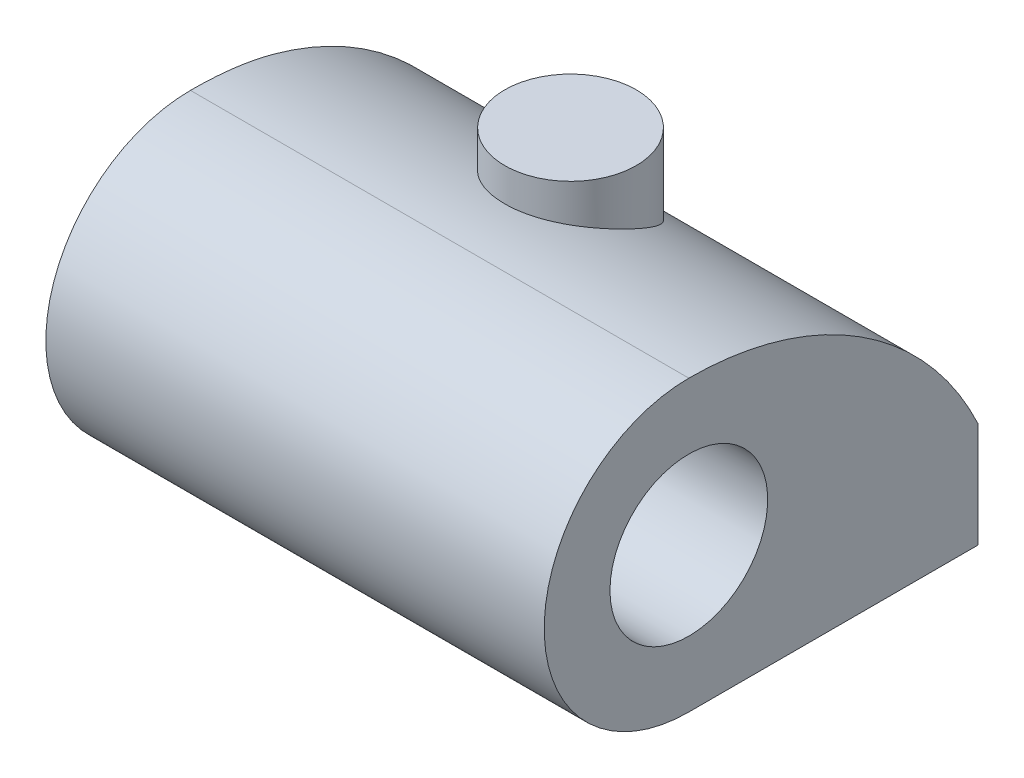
ISO-10303-21;
HEADER;
FILE_DESCRIPTION(('STEP AP214'),'2;1');
FILE_NAME('part.step','',(''),(''),'','','');
FILE_SCHEMA(('AUTOMOTIVE_DESIGN { 1 0 10303 214 1 1 1 1 }'));
ENDSEC;
DATA;
#1=APPLICATION_CONTEXT('core data for automotive mechanical design processes');
#2=APPLICATION_PROTOCOL_DEFINITION('international standard','automotive_design',2000,#1);
#3=PRODUCT_CONTEXT('',#1,'mechanical');
#4=PRODUCT('Part','Part','',(#3));
#5=PRODUCT_RELATED_PRODUCT_CATEGORY('part','',(#4));
#6=PRODUCT_DEFINITION_FORMATION('','',#4);
#7=PRODUCT_DEFINITION_CONTEXT('part definition',#1,'design');
#8=PRODUCT_DEFINITION('design','',#6,#7);
#9=PRODUCT_DEFINITION_SHAPE('','',#8);
#10=(LENGTH_UNIT() NAMED_UNIT(*) SI_UNIT(.MILLI.,.METRE.));
#11=(NAMED_UNIT(*) PLANE_ANGLE_UNIT() SI_UNIT($,.RADIAN.));
#12=(NAMED_UNIT(*) SI_UNIT($,.STERADIAN.) SOLID_ANGLE_UNIT());
#13=UNCERTAINTY_MEASURE_WITH_UNIT(LENGTH_MEASURE(1.E-05),#10,'distance_accuracy_value','');
#14=(GEOMETRIC_REPRESENTATION_CONTEXT(3) GLOBAL_UNCERTAINTY_ASSIGNED_CONTEXT((#13)) GLOBAL_UNIT_ASSIGNED_CONTEXT((#10,
#11,#12)) REPRESENTATION_CONTEXT('',''));
#15=CARTESIAN_POINT('',(0.,0.,0.));
#16=DIRECTION('',(0.,0.,1.));
#17=DIRECTION('',(1.,0.,0.));
#18=AXIS2_PLACEMENT_3D('',#15,#16,#17);
#19=CARTESIAN_POINT('',(24.13,0.,0.));
#20=DIRECTION('',(1.,0.,0.));
#21=DIRECTION('',(0.,0.,-1.));
#22=AXIS2_PLACEMENT_3D('',#19,#20,#21);
#23=PLANE('',#22);
#24=CARTESIAN_POINT('',(24.13,0.,0.));
#25=DIRECTION('',(1.,0.,0.));
#26=DIRECTION('',(0.,0.,-1.));
#27=AXIS2_PLACEMENT_3D('',#24,#25,#26);
#28=CIRCLE('',#27,6.985);
#29=CARTESIAN_POINT('',(24.13,6.985,0.));
#30=VERTEX_POINT('',#29);
#31=CARTESIAN_POINT('',(24.13,-6.985,0.));
#32=VERTEX_POINT('',#31);
#33=EDGE_CURVE('E109',#30,#32,#28,.T.);
#34=ORIENTED_EDGE('',*,*,#33,.T.);
#35=DIRECTION('',(0.,0.,-1.));
#36=VECTOR('',#35,1.);
#37=CARTESIAN_POINT('',(24.13,-6.985,0.));
#38=LINE('',#37,#36);
#39=CARTESIAN_POINT('',(24.13,-6.985,-13.97));
#40=VERTEX_POINT('',#39);
#41=EDGE_CURVE('E99',#32,#40,#38,.T.);
#42=ORIENTED_EDGE('',*,*,#41,.T.);
#43=DIRECTION('',(0.,1.,0.));
#44=VECTOR('',#43,1.);
#45=CARTESIAN_POINT('',(24.13,-6.985,-13.97));
#46=LINE('',#45,#44);
#47=CARTESIAN_POINT('',(24.13,-1.905,-13.97));
#48=VERTEX_POINT('',#47);
#49=EDGE_CURVE('E108',#40,#48,#46,.T.);
#50=ORIENTED_EDGE('',*,*,#49,.T.);
#51=CARTESIAN_POINT('',(24.13,-8.43642857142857,0.));
#52=DIRECTION('',(1.,0.,0.));
#53=DIRECTION('',(0.,0.,1.));
#54=AXIS2_PLACEMENT_3D('',#51,#52,#53);
#55=CIRCLE('',#54,15.4214285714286);
#56=EDGE_CURVE('E114',#48,#30,#55,.T.);
#57=ORIENTED_EDGE('',*,*,#56,.T.);
#58=EDGE_LOOP('',(#34,#42,#50,#57));
#59=FACE_BOUND('',#58,.T.);
#60=CARTESIAN_POINT('',(24.13,0.,0.));
#61=DIRECTION('',(1.,0.,0.));
#62=DIRECTION('',(0.,0.,-1.));
#63=AXIS2_PLACEMENT_3D('',#60,#61,#62);
#64=CIRCLE('',#63,3.81);
#65=CARTESIAN_POINT('',(24.13,0.,3.81));
#66=VERTEX_POINT('',#65);
#67=EDGE_CURVE('E153',#66,#66,#64,.T.);
#68=ORIENTED_EDGE('',*,*,#67,.F.);
#69=EDGE_LOOP('',(#68));
#70=FACE_BOUND('',#69,.T.);
#71=ADVANCED_FACE('F50',(#59,#70),#23,.T.);
#72=CARTESIAN_POINT('',(0.,0.,0.));
#73=DIRECTION('',(1.,0.,0.));
#74=DIRECTION('',(0.,0.,-1.));
#75=AXIS2_PLACEMENT_3D('',#72,#73,#74);
#76=PLANE('',#75);
#77=DIRECTION('',(0.,0.,-1.));
#78=VECTOR('',#77,1.);
#79=CARTESIAN_POINT('',(0.,-6.985,0.));
#80=LINE('',#79,#78);
#81=CARTESIAN_POINT('',(0.,-6.985,-3.04535301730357));
#82=VERTEX_POINT('',#81);
#83=CARTESIAN_POINT('',(0.,-6.985,-13.97));
#84=VERTEX_POINT('',#83);
#85=EDGE_CURVE('E174',#82,#84,#80,.T.);
#86=ORIENTED_EDGE('',*,*,#85,.F.);
#87=CARTESIAN_POINT('',(0.,0.,0.));
#88=DIRECTION('',(1.,0.,0.));
#89=DIRECTION('',(0.,0.,-1.));
#90=AXIS2_PLACEMENT_3D('',#87,#88,#89);
#91=CIRCLE('',#90,7.62);
#92=CARTESIAN_POINT('',(0.,6.43534946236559,-4.08052414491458));
#93=VERTEX_POINT('',#92);
#94=EDGE_CURVE('E118',#82,#93,#91,.T.);
#95=ORIENTED_EDGE('',*,*,#94,.T.);
#96=CARTESIAN_POINT('',(0.,-8.43642857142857,0.));
#97=DIRECTION('',(1.,0.,0.));
#98=DIRECTION('',(0.,0.,1.));
#99=AXIS2_PLACEMENT_3D('',#96,#97,#98);
#100=CIRCLE('',#99,15.4214285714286);
#101=CARTESIAN_POINT('',(0.,-1.905,-13.97));
#102=VERTEX_POINT('',#101);
#103=EDGE_CURVE('E115',#102,#93,#100,.T.);
#104=ORIENTED_EDGE('',*,*,#103,.F.);
#105=DIRECTION('',(0.,1.,0.));
#106=VECTOR('',#105,1.);
#107=CARTESIAN_POINT('',(0.,-6.985,-13.97));
#108=LINE('',#107,#106);
#109=EDGE_CURVE('E177',#84,#102,#108,.T.);
#110=ORIENTED_EDGE('',*,*,#109,.F.);
#111=EDGE_LOOP('',(#86,#95,#104,#110));
#112=FACE_BOUND('',#111,.T.);
#113=ADVANCED_FACE('F140',(#112),#76,.F.);
#114=CARTESIAN_POINT('',(24.13,0.,0.));
#115=DIRECTION('',(-1.,0.,0.));
#116=DIRECTION('',(0.,0.,1.));
#117=AXIS2_PLACEMENT_3D('',#114,#115,#116);
#118=CYLINDRICAL_SURFACE('',#117,6.985);
#119=DIRECTION('',(-1.,0.,0.));
#120=VECTOR('',#119,1.);
#121=CARTESIAN_POINT('',(24.13,6.985,0.));
#122=LINE('',#121,#120);
#123=CARTESIAN_POINT('',(0.0532893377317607,6.985,0.));
#124=VERTEX_POINT('',#123);
#125=EDGE_CURVE('E195',#30,#124,#122,.T.);
#126=ORIENTED_EDGE('',*,*,#125,.T.);
#127=CARTESIAN_POINT('',(0.0532893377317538,0.,0.));
#128=DIRECTION('',(-1.,0.,0.));
#129=DIRECTION('',(0.,0.,1.));
#130=AXIS2_PLACEMENT_3D('',#127,#128,#129);
#131=CIRCLE('',#130,6.985);
#132=CARTESIAN_POINT('',(0.0532893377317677,-6.985,0.));
#133=VERTEX_POINT('',#132);
#134=EDGE_CURVE('E66',#124,#133,#131,.F.);
#135=ORIENTED_EDGE('',*,*,#134,.T.);
#136=DIRECTION('',(-1.,0.,0.));
#137=VECTOR('',#136,1.);
#138=CARTESIAN_POINT('',(24.13,-6.985,0.));
#139=LINE('',#138,#137);
#140=EDGE_CURVE('E102',#32,#133,#139,.T.);
#141=ORIENTED_EDGE('',*,*,#140,.F.);
#142=ORIENTED_EDGE('',*,*,#33,.F.);
#143=EDGE_LOOP('',(#126,#135,#141,#142));
#144=FACE_BOUND('',#143,.T.);
#145=ADVANCED_FACE('F117',(#144),#118,.T.);
#146=CARTESIAN_POINT('',(24.13,-6.985,0.));
#147=DIRECTION('',(0.,1.,0.));
#148=DIRECTION('',(0.,0.,1.));
#149=AXIS2_PLACEMENT_3D('',#146,#147,#148);
#150=PLANE('',#149);
#151=ORIENTED_EDGE('',*,*,#140,.T.);
#152=CARTESIAN_POINT('',(0.0532893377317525,-6.985,0.));
#153=CARTESIAN_POINT('',(0.0533115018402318,-6.985,-0.12692119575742));
#154=CARTESIAN_POINT('',(0.0527051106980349,-6.985,-0.253840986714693));
#155=CARTESIAN_POINT('',(0.0503973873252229,-6.985,-0.507664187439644));
#156=CARTESIAN_POINT('',(0.0486961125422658,-6.985,-0.634567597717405));
#157=CARTESIAN_POINT('',(0.0443607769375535,-6.985,-0.888356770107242));
#158=CARTESIAN_POINT('',(0.0417267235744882,-6.985,-1.01524253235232));
#159=CARTESIAN_POINT('',(0.0358401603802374,-6.985,-1.26900143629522));
#160=CARTESIAN_POINT('',(0.0325876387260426,-6.985,-1.39587457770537));
#161=CARTESIAN_POINT('',(0.0224800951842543,-6.985,-1.77646981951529));
#162=CARTESIAN_POINT('',(0.0152747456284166,-6.985,-2.03018299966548));
#163=CARTESIAN_POINT('',(0.00684661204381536,-6.985,-2.41081524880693));
#164=CARTESIAN_POINT('',(0.00443386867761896,-6.985,-2.5377045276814));
#165=CARTESIAN_POINT('',(0.00101169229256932,-6.985,-2.79151091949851));
#166=CARTESIAN_POINT('',(2.37026673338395E-06,-6.985,-2.91842803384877));
#167=CARTESIAN_POINT('',(0.,-6.985,-3.04535301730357));
#168=B_SPLINE_CURVE_WITH_KNOTS('',3,(#152,#153,#154,#155,#156,#157,#158,#159,#160,#161,#162,
#163,#164,#165,#166,#167),.UNSPECIFIED.,.F.,.F.,(4,2,2,2,2,2,2,4),(0.,0.380759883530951,
0.761499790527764,1.14223665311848,1.52298079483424,2.28442327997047,2.66515321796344,
3.0459132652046),.UNSPECIFIED.);
#169=EDGE_CURVE('E59',#133,#82,#168,.T.);
#170=ORIENTED_EDGE('',*,*,#169,.T.);
#171=ORIENTED_EDGE('',*,*,#85,.T.);
#172=DIRECTION('',(-1.,0.,0.));
#173=VECTOR('',#172,1.);
#174=CARTESIAN_POINT('',(24.13,-6.985,-13.97));
#175=LINE('',#174,#173);
#176=EDGE_CURVE('E105',#40,#84,#175,.T.);
#177=ORIENTED_EDGE('',*,*,#176,.F.);
#178=ORIENTED_EDGE('',*,*,#41,.F.);
#179=EDGE_LOOP('',(#151,#170,#171,#177,#178));
#180=FACE_BOUND('',#179,.T.);
#181=ADVANCED_FACE('F101',(#180),#150,.F.);
#182=CARTESIAN_POINT('',(24.13,-6.985,-13.97));
#183=DIRECTION('',(0.,0.,1.));
#184=DIRECTION('',(0.,-1.,0.));
#185=AXIS2_PLACEMENT_3D('',#182,#183,#184);
#186=PLANE('',#185);
#187=ORIENTED_EDGE('',*,*,#109,.T.);
#188=DIRECTION('',(-1.,0.,0.));
#189=VECTOR('',#188,1.);
#190=CARTESIAN_POINT('',(24.13,-1.905,-13.97));
#191=LINE('',#190,#189);
#192=EDGE_CURVE('E122',#48,#102,#191,.T.);
#193=ORIENTED_EDGE('',*,*,#192,.F.);
#194=ORIENTED_EDGE('',*,*,#49,.F.);
#195=ORIENTED_EDGE('',*,*,#176,.T.);
#196=EDGE_LOOP('',(#187,#193,#194,#195));
#197=FACE_BOUND('',#196,.T.);
#198=ADVANCED_FACE('F138',(#197),#186,.F.);
#199=CARTESIAN_POINT('',(24.13,-8.43642857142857,0.));
#200=DIRECTION('',(-1.,0.,0.));
#201=DIRECTION('',(0.,0.,1.));
#202=AXIS2_PLACEMENT_3D('',#199,#200,#201);
#203=CYLINDRICAL_SURFACE('',#202,15.4214285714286);
#204=CARTESIAN_POINT('',(12.065,3.69183734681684,-9.525));
#205=CARTESIAN_POINT('',(12.2188541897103,3.69183729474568,-9.52500016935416));
#206=CARTESIAN_POINT('',(12.3727087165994,3.70070118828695,-9.51374581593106));
#207=CARTESIAN_POINT('',(12.6753307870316,3.73521842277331,-9.4695418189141));
#208=CARTESIAN_POINT('',(12.8240955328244,3.7608808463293,-9.43658043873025));
#209=CARTESIAN_POINT('',(13.1115713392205,3.8263942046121,-9.35128187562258));
#210=CARTESIAN_POINT('',(13.2503347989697,3.86616355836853,-9.29905603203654));
#211=CARTESIAN_POINT('',(13.516225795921,3.95694823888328,-9.17771194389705));
#212=CARTESIAN_POINT('',(13.6433494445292,4.00796730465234,-9.10858808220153));
#213=CARTESIAN_POINT('',(13.8961814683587,4.12368544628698,-8.94844377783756));
#214=CARTESIAN_POINT('',(14.0205639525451,4.18923035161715,-8.85595220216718));
#215=CARTESIAN_POINT('',(14.2525854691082,4.32701148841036,-8.65620042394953));
#216=CARTESIAN_POINT('',(14.3602160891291,4.39925105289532,-8.54893285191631));
#217=CARTESIAN_POINT('',(14.5779976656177,4.56261984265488,-8.29889749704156));
#218=CARTESIAN_POINT('',(14.6842920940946,4.65462366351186,-8.15333065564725));
#219=CARTESIAN_POINT('',(14.8705693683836,4.84040608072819,-7.84718114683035));
#220=CARTESIAN_POINT('',(14.9505326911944,4.93418593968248,-7.68658745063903));
#221=CARTESIAN_POINT('',(15.0900484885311,5.13077543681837,-7.33460469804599));
#222=CARTESIAN_POINT('',(15.1462799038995,5.23340999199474,-7.14178547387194));
#223=CARTESIAN_POINT('',(15.2216217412,5.43294750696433,-6.74610470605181));
#224=CARTESIAN_POINT('',(15.2407336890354,5.52985070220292,-6.54324357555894));
#225=CARTESIAN_POINT('',(15.2392409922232,5.7124697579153,-6.13818587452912));
#226=CARTESIAN_POINT('',(15.2195421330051,5.79839208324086,-5.9360818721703));
#227=CARTESIAN_POINT('',(15.1404435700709,5.95901115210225,-5.53518778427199));
#228=CARTESIAN_POINT('',(15.0810727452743,6.03371601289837,-5.33639539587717));
#229=CARTESIAN_POINT('',(14.930242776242,6.16362263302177,-4.96923023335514));
#230=CARTESIAN_POINT('',(14.8424399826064,6.22001158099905,-4.79977444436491));
#231=CARTESIAN_POINT('',(14.6359330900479,6.32176027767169,-4.47715594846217));
#232=CARTESIAN_POINT('',(14.5172443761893,6.36712549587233,-4.32398518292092));
#233=CARTESIAN_POINT('',(14.2628041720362,6.44385157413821,-4.0516906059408));
#234=CARTESIAN_POINT('',(14.1291551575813,6.4760382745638,-3.93082926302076));
#235=CARTESIAN_POINT('',(13.842172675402,6.53180888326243,-3.71281824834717));
#236=CARTESIAN_POINT('',(13.6888433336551,6.5553945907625,-3.61566361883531));
#237=CARTESIAN_POINT('',(13.3725189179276,6.59404084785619,-3.45142848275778));
#238=CARTESIAN_POINT('',(13.2100232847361,6.6093617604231,-3.38344532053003));
#239=CARTESIAN_POINT('',(12.8755826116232,6.63329923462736,-3.27518847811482));
#240=CARTESIAN_POINT('',(12.7036380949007,6.64191616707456,-3.23491326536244));
#241=CARTESIAN_POINT('',(12.3565960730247,6.65283542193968,-3.18359279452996));
#242=CARTESIAN_POINT('',(12.1815326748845,6.65518546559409,-3.17232666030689));
#243=CARTESIAN_POINT('',(11.8319604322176,6.65383540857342,-3.17874223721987));
#244=CARTESIAN_POINT('',(11.6574515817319,6.65013537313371,-3.19642363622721));
#245=CARTESIAN_POINT('',(11.314064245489,6.63649250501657,-3.26014666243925));
#246=CARTESIAN_POINT('',(11.1451820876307,6.62655383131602,-3.30616939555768));
#247=CARTESIAN_POINT('',(10.8177178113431,6.59996337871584,-3.42506380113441));
#248=CARTESIAN_POINT('',(10.6591354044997,6.58331178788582,-3.49793472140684));
#249=CARTESIAN_POINT('',(10.356612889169,6.54264273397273,-3.66817547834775));
#250=CARTESIAN_POINT('',(10.2126829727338,6.51862018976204,-3.76556220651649));
#251=CARTESIAN_POINT('',(9.94351167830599,6.46257628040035,-3.98152238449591));
#252=CARTESIAN_POINT('',(9.81826981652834,6.43055512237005,-4.10009528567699));
#253=CARTESIAN_POINT('',(9.58874393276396,6.35778461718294,-4.35539030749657));
#254=CARTESIAN_POINT('',(9.48462575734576,6.31697102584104,-4.49224303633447));
#255=CARTESIAN_POINT('',(9.30076555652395,6.22665292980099,-4.77881281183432));
#256=CARTESIAN_POINT('',(9.22102572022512,6.17714764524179,-4.92853101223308));
#257=CARTESIAN_POINT('',(9.08503074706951,6.06813825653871,-5.24081533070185));
#258=CARTESIAN_POINT('',(9.02956515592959,6.00837546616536,-5.4036339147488));
#259=CARTESIAN_POINT('',(8.94587929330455,5.88082622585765,-5.73305357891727));
#260=CARTESIAN_POINT('',(8.91766680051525,5.81303749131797,-5.89965572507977));
#261=CARTESIAN_POINT('',(8.88677258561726,5.66586345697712,-6.24364685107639));
#262=CARTESIAN_POINT('',(8.88595868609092,5.58600294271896,-6.42099845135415));
#263=CARTESIAN_POINT('',(8.91310767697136,5.4205338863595,-6.77071214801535));
#264=CARTESIAN_POINT('',(8.94108040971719,5.3349233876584,-6.94307251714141));
#265=CARTESIAN_POINT('',(9.02802728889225,5.15194813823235,-7.29516461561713));
#266=CARTESIAN_POINT('',(9.08967843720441,5.05423664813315,-7.47405648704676));
#267=CARTESIAN_POINT('',(9.24341580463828,4.85792154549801,-7.8179280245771));
#268=CARTESIAN_POINT('',(9.33553180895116,4.75931715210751,-7.98289387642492));
#269=CARTESIAN_POINT('',(9.55548181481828,4.55893611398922,-8.30537522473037));
#270=CARTESIAN_POINT('',(9.68524531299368,4.45736866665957,-8.46171309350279));
#271=CARTESIAN_POINT('',(9.97582134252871,4.26382880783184,-8.74951013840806));
#272=CARTESIAN_POINT('',(10.1365911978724,4.17184347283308,-8.88100302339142));
#273=CARTESIAN_POINT('',(10.4399647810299,4.02750510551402,-9.08195149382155));
#274=CARTESIAN_POINT('',(10.5759115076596,3.97113430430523,-9.15859140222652));
#275=CARTESIAN_POINT('',(10.8615049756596,3.87133315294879,-9.29227759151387));
#276=CARTESIAN_POINT('',(11.0111343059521,3.82788664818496,-9.34934834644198));
#277=CARTESIAN_POINT('',(11.3095782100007,3.76020539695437,-9.43745056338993));
#278=CARTESIAN_POINT('',(11.4576452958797,3.73479387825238,-9.47008680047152));
#279=CARTESIAN_POINT('',(11.7588098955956,3.70061415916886,-9.51385590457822));
#280=CARTESIAN_POINT('',(11.9119047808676,3.69183739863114,-9.52499983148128));
#281=CARTESIAN_POINT('',(12.065,3.69183734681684,-9.525));
#282=B_SPLINE_CURVE_WITH_KNOTS('',3,(#204,#205,#206,#207,#208,#209,#210,#211,#212,#213,#214,
#215,#216,#217,#218,#219,#220,#221,#222,#223,#224,#225,#226,#227,#228,#229,#230,#231,#232,#233,
#234,#235,#236,#237,#238,#239,#240,#241,#242,#243,#244,#245,#246,#247,#248,#249,#250,#251,#252,
#253,#254,#255,#256,#257,#258,#259,#260,#261,#262,#263,#264,#265,#266,#267,#268,#269,#270,#271,
#272,#273,#274,#275,#276,#277,#278,#279,#280,#281),.UNSPECIFIED.,.T.,.F.,(4,2,2,2,2,2,2,2,2,2,2,
2,2,2,2,2,2,2,2,2,2,2,2,2,2,2,2,2,2,2,2,2,2,2,2,2,2,2,4),(0.,0.460929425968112,
0.922108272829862,1.38066245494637,1.8393692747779,2.34243859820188,2.84575974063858,
3.45043022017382,4.05554802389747,4.7289431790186,5.40231065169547,6.0601488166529,
6.71750863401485,7.31132831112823,7.90485275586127,8.45126069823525,8.99755427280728,
9.52544947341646,10.0533154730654,10.5771502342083,11.1009793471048,11.624459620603,
12.147925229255,12.6717524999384,13.1955662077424,13.7233456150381,14.2511724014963,
14.7950808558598,15.3391445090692,15.920228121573,16.5015104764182,17.1376600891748,
17.7744335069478,18.4525172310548,19.129674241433,19.6255685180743,20.120840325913,
20.5797321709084,21.0383878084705),.UNSPECIFIED.);
#283=CARTESIAN_POINT('',(12.065,3.69183734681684,-9.525));
#284=VERTEX_POINT('',#283);
#285=EDGE_CURVE('E145',#284,#284,#282,.T.);
#286=ORIENTED_EDGE('',*,*,#285,.T.);
#287=EDGE_LOOP('',(#286));
#288=FACE_BOUND('',#287,.T.);
#289=ORIENTED_EDGE('',*,*,#103,.T.);
#290=CARTESIAN_POINT('',(0.,6.43534946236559,-4.08052414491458));
#291=CARTESIAN_POINT('',(1.24183508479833E-06,6.48099109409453,-3.91417799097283));
#292=CARTESIAN_POINT('',(0.00100410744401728,6.52383596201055,-3.74708931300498));
#293=CARTESIAN_POINT('',(0.00441302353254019,6.60389284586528,-3.41158929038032));
#294=CARTESIAN_POINT('',(0.00681901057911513,6.64110511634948,-3.2431780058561));
#295=CARTESIAN_POINT('',(0.015215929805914,6.7439228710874,-2.73773941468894));
#296=CARTESIAN_POINT('',(0.0223969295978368,6.80113057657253,-2.39897070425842));
#297=CARTESIAN_POINT('',(0.0324947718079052,6.86988324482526,-1.88859138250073));
#298=CARTESIAN_POINT('',(0.0357486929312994,6.88995864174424,-1.71807919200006));
#299=CARTESIAN_POINT('',(0.0416445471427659,6.9244073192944,-1.37646033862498));
#300=CARTESIAN_POINT('',(0.0442864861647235,6.93878065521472,-1.20535368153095));
#301=CARTESIAN_POINT('',(0.0486504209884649,6.96185693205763,-0.861977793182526));
#302=CARTESIAN_POINT('',(0.0503682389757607,6.9705341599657,-0.689706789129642));
#303=CARTESIAN_POINT('',(0.0526991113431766,6.98210635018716,-0.344957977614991));
#304=CARTESIAN_POINT('',(0.0533121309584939,6.98500113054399,-0.172480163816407));
#305=CARTESIAN_POINT('',(0.0532893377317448,6.985,0.));
#306=B_SPLINE_CURVE_WITH_KNOTS('',3,(#290,#291,#292,#293,#294,#295,#296,#297,#298,#299,#300,
#301,#302,#303,#304,#305),.UNSPECIFIED.,.F.,.F.,(4,2,2,2,2,2,2,4),(0.,0.517410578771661,
1.0347977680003,2.06480146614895,2.57989160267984,3.09497674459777,3.61237134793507,
4.12978223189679),.UNSPECIFIED.);
#307=EDGE_CURVE('E74',#93,#124,#306,.T.);
#308=ORIENTED_EDGE('',*,*,#307,.T.);
#309=ORIENTED_EDGE('',*,*,#125,.F.);
#310=ORIENTED_EDGE('',*,*,#56,.F.);
#311=ORIENTED_EDGE('',*,*,#192,.T.);
#312=EDGE_LOOP('',(#289,#308,#309,#310,#311));
#313=FACE_BOUND('',#312,.T.);
#314=ADVANCED_FACE('F132',(#288,#313),#203,.T.);
#315=CARTESIAN_POINT('',(24.13,0.,0.));
#316=DIRECTION('',(-1.,0.,0.));
#317=DIRECTION('',(0.,0.,1.));
#318=AXIS2_PLACEMENT_3D('',#315,#316,#317);
#319=CYLINDRICAL_SURFACE('',#318,3.81);
#320=CARTESIAN_POINT('',(3.81,0.,0.));
#321=DIRECTION('',(1.,0.,0.));
#322=DIRECTION('',(0.,0.,-1.));
#323=AXIS2_PLACEMENT_3D('',#320,#321,#322);
#324=CIRCLE('',#323,3.81);
#325=CARTESIAN_POINT('',(3.81,0.,3.81));
#326=VERTEX_POINT('',#325);
#327=EDGE_CURVE('E14',#326,#326,#324,.F.);
#328=CARTESIAN_POINT('',(3.81,0.,3.81));
#329=CARTESIAN_POINT('',(4.02166666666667,0.,3.81));
#330=CARTESIAN_POINT('',(4.23333333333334,0.,3.81));
#331=CARTESIAN_POINT('',(4.65666666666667,0.,3.81));
#332=CARTESIAN_POINT('',(4.86833333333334,0.,3.81));
#333=CARTESIAN_POINT('',(5.29166666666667,0.,3.81));
#334=CARTESIAN_POINT('',(5.50333333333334,0.,3.81));
#335=CARTESIAN_POINT('',(5.92666666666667,0.,3.81));
#336=CARTESIAN_POINT('',(6.13833333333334,0.,3.81));
#337=CARTESIAN_POINT('',(6.56166666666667,0.,3.81));
#338=CARTESIAN_POINT('',(6.77333333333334,0.,3.81));
#339=CARTESIAN_POINT('',(7.19666666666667,0.,3.81));
#340=CARTESIAN_POINT('',(7.40833333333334,0.,3.81));
#341=CARTESIAN_POINT('',(7.83166666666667,0.,3.81));
#342=CARTESIAN_POINT('',(8.04333333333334,0.,3.81));
#343=CARTESIAN_POINT('',(8.46666666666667,0.,3.81));
#344=CARTESIAN_POINT('',(8.67833333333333,0.,3.81));
#345=CARTESIAN_POINT('',(9.10166666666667,0.,3.81));
#346=CARTESIAN_POINT('',(9.31333333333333,0.,3.81));
#347=CARTESIAN_POINT('',(9.73666666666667,0.,3.81));
#348=CARTESIAN_POINT('',(9.94833333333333,0.,3.81));
#349=CARTESIAN_POINT('',(10.3716666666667,0.,3.81));
#350=CARTESIAN_POINT('',(10.5833333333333,0.,3.81));
#351=CARTESIAN_POINT('',(11.0066666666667,0.,3.81));
#352=CARTESIAN_POINT('',(11.2183333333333,0.,3.81));
#353=CARTESIAN_POINT('',(11.6416666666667,0.,3.81));
#354=CARTESIAN_POINT('',(11.8533333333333,0.,3.81));
#355=CARTESIAN_POINT('',(12.2766666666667,0.,3.81));
#356=CARTESIAN_POINT('',(12.4883333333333,0.,3.81));
#357=CARTESIAN_POINT('',(12.9116666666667,0.,3.81));
#358=CARTESIAN_POINT('',(13.1233333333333,0.,3.81));
#359=CARTESIAN_POINT('',(13.5466666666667,0.,3.81));
#360=CARTESIAN_POINT('',(13.7583333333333,0.,3.81));
#361=CARTESIAN_POINT('',(14.1816666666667,0.,3.81));
#362=CARTESIAN_POINT('',(14.3933333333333,0.,3.81));
#363=CARTESIAN_POINT('',(14.8166666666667,0.,3.81));
#364=CARTESIAN_POINT('',(15.0283333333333,0.,3.81));
#365=CARTESIAN_POINT('',(15.4516666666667,0.,3.81));
#366=CARTESIAN_POINT('',(15.6633333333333,0.,3.81));
#367=CARTESIAN_POINT('',(16.0866666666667,0.,3.81));
#368=CARTESIAN_POINT('',(16.2983333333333,0.,3.81));
#369=CARTESIAN_POINT('',(16.7216666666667,0.,3.81));
#370=CARTESIAN_POINT('',(16.9333333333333,0.,3.81));
#371=CARTESIAN_POINT('',(17.3566666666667,0.,3.81));
#372=CARTESIAN_POINT('',(17.5683333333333,0.,3.81));
#373=CARTESIAN_POINT('',(17.9916666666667,0.,3.81));
#374=CARTESIAN_POINT('',(18.2033333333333,0.,3.81));
#375=CARTESIAN_POINT('',(18.6266666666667,0.,3.81));
#376=CARTESIAN_POINT('',(18.8383333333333,0.,3.81));
#377=CARTESIAN_POINT('',(19.2616666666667,0.,3.81));
#378=CARTESIAN_POINT('',(19.4733333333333,0.,3.81));
#379=CARTESIAN_POINT('',(19.8966666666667,0.,3.81));
#380=CARTESIAN_POINT('',(20.1083333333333,0.,3.81));
#381=CARTESIAN_POINT('',(20.5316666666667,0.,3.81));
#382=CARTESIAN_POINT('',(20.7433333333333,0.,3.81));
#383=CARTESIAN_POINT('',(21.1666666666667,0.,3.81));
#384=CARTESIAN_POINT('',(21.3783333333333,0.,3.81));
#385=CARTESIAN_POINT('',(21.8016666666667,0.,3.81));
#386=CARTESIAN_POINT('',(22.0133333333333,0.,3.81));
#387=CARTESIAN_POINT('',(22.4366666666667,0.,3.81));
#388=CARTESIAN_POINT('',(22.6483333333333,0.,3.81));
#389=CARTESIAN_POINT('',(23.0716666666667,0.,3.81));
#390=CARTESIAN_POINT('',(23.2833333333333,0.,3.81));
#391=CARTESIAN_POINT('',(23.7066666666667,0.,3.81));
#392=CARTESIAN_POINT('',(23.9183333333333,0.,3.81));
#393=CARTESIAN_POINT('',(24.13,0.,3.81));
#394=B_SPLINE_CURVE_WITH_KNOTS('',3,(#328,#329,#330,#331,#332,#333,#334,#335,#336,#337,#338,
#339,#340,#341,#342,#343,#344,#345,#346,#347,#348,#349,#350,#351,#352,#353,#354,#355,#356,#357,
#358,#359,#360,#361,#362,#363,#364,#365,#366,#367,#368,#369,#370,#371,#372,#373,#374,#375,#376,
#377,#378,#379,#380,#381,#382,#383,#384,#385,#386,#387,#388,#389,#390,#391,#392,#393),
.UNSPECIFIED.,.F.,.F.,(4,2,2,2,2,2,2,2,2,2,2,2,2,2,2,2,2,2,2,2,2,2,2,2,2,2,2,2,2,2,2,2,4),(0.,
0.635,1.27,1.905,2.54,3.175,3.81,4.445,5.08,5.715,6.35,6.985,7.62,8.255,8.89,9.525,10.16,10.795,
11.43,12.065,12.7,13.335,13.97,14.605,15.24,15.875,16.51,17.145,17.78,18.415,19.05,19.685,
20.32),.UNSPECIFIED.);
#395=EDGE_CURVE('BSEAM137',#326,#66,#394,.T.);
#396=ORIENTED_EDGE('',*,*,#327,.T.);
#397=ORIENTED_EDGE('',*,*,#67,.T.);
#398=ORIENTED_EDGE('',*,*,#395,.T.);
#399=ORIENTED_EDGE('',*,*,#395,.F.);
#400=EDGE_LOOP('',(#396,#398,#397,#399));
#401=FACE_BOUND('',#400,.T.);
#402=ADVANCED_FACE('F137',(#401),#319,.F.);
#403=CARTESIAN_POINT('',(3.81,0.,0.));
#404=DIRECTION('',(1.,0.,0.));
#405=DIRECTION('',(0.,0.,-1.));
#406=AXIS2_PLACEMENT_3D('',#403,#404,#405);
#407=TOROIDAL_SURFACE('',#406,7.62,3.81);
#408=ORIENTED_EDGE('',*,*,#327,.F.);
#409=EDGE_LOOP('',(#408));
#410=FACE_BOUND('',#409,.T.);
#411=ORIENTED_EDGE('',*,*,#307,.F.);
#412=ORIENTED_EDGE('',*,*,#94,.F.);
#413=ORIENTED_EDGE('',*,*,#169,.F.);
#414=ORIENTED_EDGE('',*,*,#134,.F.);
#415=EDGE_LOOP('',(#411,#412,#413,#414));
#416=FACE_BOUND('',#415,.T.);
#417=ADVANCED_FACE('F52',(#410,#416),#407,.T.);
#418=CARTESIAN_POINT('',(12.065,8.255,-6.35));
#419=DIRECTION('',(0.,-1.,0.));
#420=DIRECTION('',(0.,0.,-1.));
#421=AXIS2_PLACEMENT_3D('',#418,#419,#420);
#422=CYLINDRICAL_SURFACE('',#421,3.175);
#423=CARTESIAN_POINT('',(12.065,8.255,-6.35));
#424=DIRECTION('',(0.,-1.,0.));
#425=DIRECTION('',(0.,0.,-1.));
#426=AXIS2_PLACEMENT_3D('',#423,#424,#425);
#427=CIRCLE('',#426,3.175);
#428=CARTESIAN_POINT('',(12.065,8.255,-9.525));
#429=VERTEX_POINT('',#428);
#430=EDGE_CURVE('E154',#429,#429,#427,.T.);
#431=ORIENTED_EDGE('',*,*,#430,.T.);
#432=EDGE_LOOP('',(#431));
#433=FACE_BOUND('',#432,.T.);
#434=ORIENTED_EDGE('',*,*,#285,.F.);
#435=EDGE_LOOP('',(#434));
#436=FACE_BOUND('',#435,.T.);
#437=ADVANCED_FACE('F155',(#433,#436),#422,.T.);
#438=CARTESIAN_POINT('',(12.065,8.255,-6.35));
#439=DIRECTION('',(0.,-1.,0.));
#440=DIRECTION('',(0.,0.,-1.));
#441=AXIS2_PLACEMENT_3D('',#438,#439,#440);
#442=PLANE('',#441);
#443=ORIENTED_EDGE('',*,*,#430,.F.);
#444=EDGE_LOOP('',(#443));
#445=FACE_BOUND('',#444,.T.);
#446=ADVANCED_FACE('F160',(#445),#442,.F.);
#447=CLOSED_SHELL('',(#71,#113,#145,#181,#198,#314,#402,#417,#437,#446));
#448=MANIFOLD_SOLID_BREP('B2',#447);
#449=ADVANCED_BREP_SHAPE_REPRESENTATION('',(#18,#448),#14);
#450=SHAPE_DEFINITION_REPRESENTATION(#9,#449);
ENDSEC;
END-ISO-10303-21;
